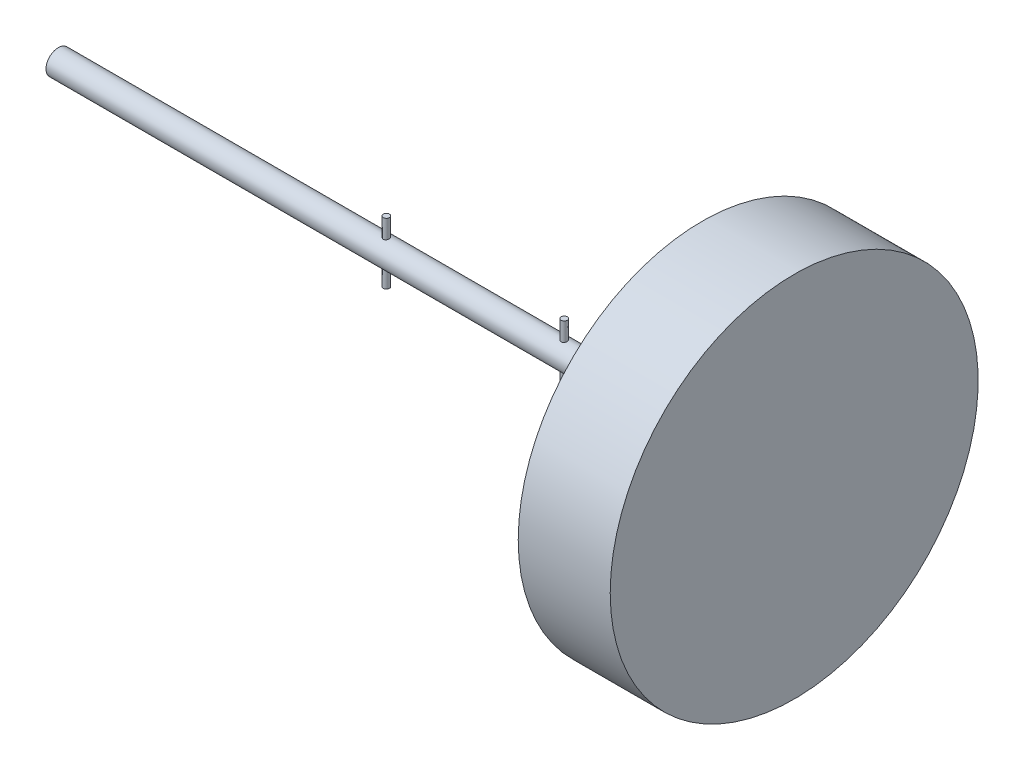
from build123d import *

# Parameters (mm, degrees)
BOSS_EXTRU_1_DEPTH      = 50
BOSS_EXTRU_1_DEPTH_BACK = 50
ESQUISSE2_R             = 5


with BuildPart() as part:
    # Esquisse1 → R_volution1 (revolve)
    with BuildSketch(Plane.XY, mode=Mode.PRIVATE) as r_volution1_sk:
        Polygon((-1125, 0), (75, 0), (75, 300), (-75, 300), (-75, 20), (-1125, 20), align=None)
    revolve(r_volution1_sk.sketch.rotate(Axis((-1125, 0, 0), (1, 0, 0)), 90), axis=Axis((-1125, 0, 0), (1, 0, 0)))

    # Esquisse2 → Boss.-Extru.1 (add, two sides: drawn at the far end of the back side and taken through both)
    with BuildSketch(Plane(origin=(0, 0, 0), x_dir=(1, 0, 0), z_dir=(0, 1, 0)).offset(-BOSS_EXTRU_1_DEPTH_BACK)):
        with Locations(Location((-590, 0, 0), (0, 0, 270))):
            Circle(ESQUISSE2_R)
        with Locations(Location((-300, 0, 0), (0, 0, 270))):
            Circle(ESQUISSE2_R)
    extrude(amount=BOSS_EXTRU_1_DEPTH + BOSS_EXTRU_1_DEPTH_BACK)


solid = part.part
